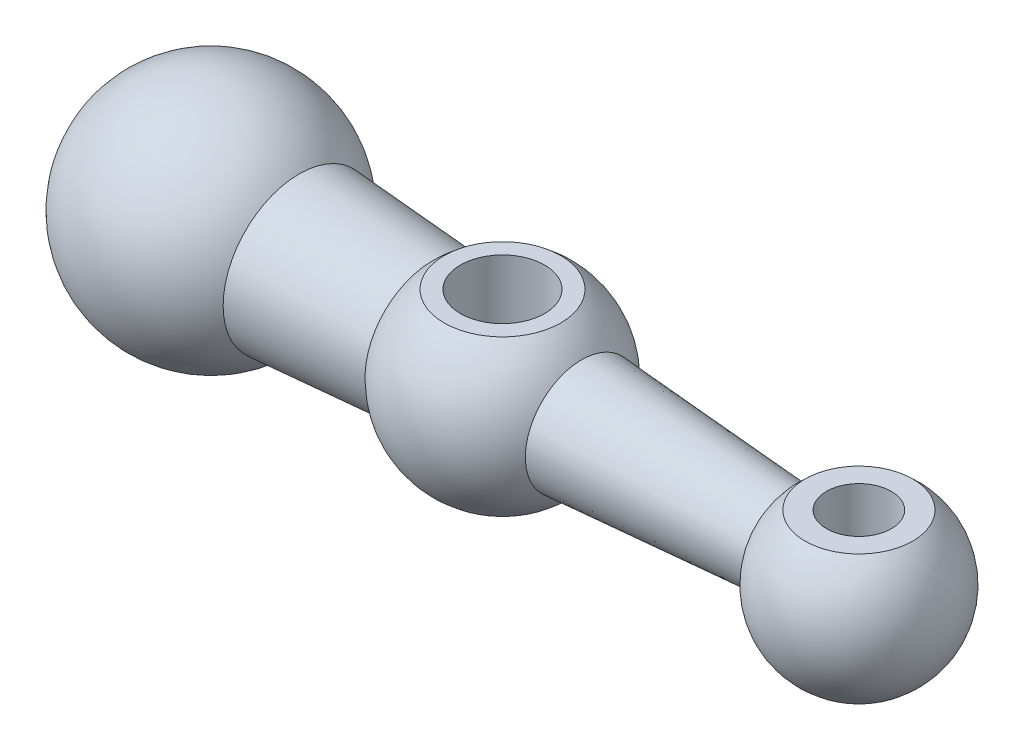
ISO-10303-21;
HEADER;
FILE_DESCRIPTION(('STEP AP214'),'2;1');
FILE_NAME('part.step','',(''),(''),'','','');
FILE_SCHEMA(('AUTOMOTIVE_DESIGN { 1 0 10303 214 1 1 1 1 }'));
ENDSEC;
DATA;
#1=APPLICATION_CONTEXT('core data for automotive mechanical design processes');
#2=APPLICATION_PROTOCOL_DEFINITION('international standard','automotive_design',2000,#1);
#3=PRODUCT_CONTEXT('',#1,'mechanical');
#4=PRODUCT('Part','Part','',(#3));
#5=PRODUCT_RELATED_PRODUCT_CATEGORY('part','',(#4));
#6=PRODUCT_DEFINITION_FORMATION('','',#4);
#7=PRODUCT_DEFINITION_CONTEXT('part definition',#1,'design');
#8=PRODUCT_DEFINITION('design','',#6,#7);
#9=PRODUCT_DEFINITION_SHAPE('','',#8);
#10=(LENGTH_UNIT() NAMED_UNIT(*) SI_UNIT(.MILLI.,.METRE.));
#11=(NAMED_UNIT(*) PLANE_ANGLE_UNIT() SI_UNIT($,.RADIAN.));
#12=(NAMED_UNIT(*) SI_UNIT($,.STERADIAN.) SOLID_ANGLE_UNIT());
#13=UNCERTAINTY_MEASURE_WITH_UNIT(LENGTH_MEASURE(1.E-05),#10,'distance_accuracy_value','');
#14=(GEOMETRIC_REPRESENTATION_CONTEXT(3) GLOBAL_UNCERTAINTY_ASSIGNED_CONTEXT((#13)) GLOBAL_UNIT_ASSIGNED_CONTEXT((#10,
#11,#12)) REPRESENTATION_CONTEXT('',''));
#15=CARTESIAN_POINT('',(0.,0.,0.));
#16=DIRECTION('',(0.,0.,1.));
#17=DIRECTION('',(1.,0.,0.));
#18=AXIS2_PLACEMENT_3D('',#15,#16,#17);
#19=CARTESIAN_POINT('',(10.,0.,0.));
#20=DIRECTION('',(-1.,0.,0.));
#21=DIRECTION('',(0.,0.,-1.));
#22=AXIS2_PLACEMENT_3D('',#19,#20,#21);
#23=CONICAL_SURFACE('',#22,12.,0.0698131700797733);
#24=CARTESIAN_POINT('',(88.7382566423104,0.,0.));
#25=DIRECTION('',(1.,0.,0.));
#26=DIRECTION('',(0.,0.,-1.));
#27=AXIS2_PLACEMENT_3D('',#24,#25,#26);
#28=CIRCLE('',#27,6.49408473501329);
#29=CARTESIAN_POINT('',(88.7382566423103,0.,-6.49408473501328));
#30=VERTEX_POINT('',#29);
#31=EDGE_CURVE('E59',#30,#30,#28,.T.);
#32=CARTESIAN_POINT('',(57.2206640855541,0.,0.));
#33=DIRECTION('',(-1.,0.,0.));
#34=DIRECTION('',(0.,0.,1.));
#35=AXIS2_PLACEMENT_3D('',#32,#33,#34);
#36=CIRCLE('',#35,8.69800950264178);
#37=CARTESIAN_POINT('',(57.2206640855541,0.,-8.69800950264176));
#38=VERTEX_POINT('',#37);
#39=EDGE_CURVE('E11',#38,#38,#36,.T.);
#40=CARTESIAN_POINT('',(88.7382566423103,0.,-6.49408473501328));
#41=CARTESIAN_POINT('',(88.4099483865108,0.,-6.51704228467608));
#42=CARTESIAN_POINT('',(88.0816401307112,0.,-6.53999983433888));
#43=CARTESIAN_POINT('',(87.4250236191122,0.,-6.58591493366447));
#44=CARTESIAN_POINT('',(87.0967153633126,0.,-6.60887248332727));
#45=CARTESIAN_POINT('',(86.4400988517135,0.,-6.65478758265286));
#46=CARTESIAN_POINT('',(86.111790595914,0.,-6.67774513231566));
#47=CARTESIAN_POINT('',(85.4551740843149,0.,-6.72366023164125));
#48=CARTESIAN_POINT('',(85.1268658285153,0.,-6.74661778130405));
#49=CARTESIAN_POINT('',(84.4702493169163,0.,-6.79253288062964));
#50=CARTESIAN_POINT('',(84.1419410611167,0.,-6.81549043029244));
#51=CARTESIAN_POINT('',(83.4853245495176,0.,-6.86140552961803));
#52=CARTESIAN_POINT('',(83.1570162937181,0.,-6.88436307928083));
#53=CARTESIAN_POINT('',(82.500399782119,0.,-6.93027817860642));
#54=CARTESIAN_POINT('',(82.1720915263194,0.,-6.95323572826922));
#55=CARTESIAN_POINT('',(81.5154750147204,0.,-6.99915082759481));
#56=CARTESIAN_POINT('',(81.1871667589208,0.,-7.02210837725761));
#57=CARTESIAN_POINT('',(80.5305502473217,0.,-7.0680234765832));
#58=CARTESIAN_POINT('',(80.2022419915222,0.,-7.090981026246));
#59=CARTESIAN_POINT('',(79.5456254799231,0.,-7.13689612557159));
#60=CARTESIAN_POINT('',(79.2173172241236,0.,-7.15985367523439));
#61=CARTESIAN_POINT('',(78.5607007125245,0.,-7.20576877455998));
#62=CARTESIAN_POINT('',(78.2323924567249,0.,-7.22872632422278));
#63=CARTESIAN_POINT('',(77.5757759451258,0.,-7.27464142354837));
#64=CARTESIAN_POINT('',(77.2474676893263,0.,-7.29759897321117));
#65=CARTESIAN_POINT('',(76.5908511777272,0.,-7.34351407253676));
#66=CARTESIAN_POINT('',(76.2625429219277,0.,-7.36647162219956));
#67=CARTESIAN_POINT('',(75.6059264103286,0.,-7.41238672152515));
#68=CARTESIAN_POINT('',(75.277618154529,0.,-7.43534427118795));
#69=CARTESIAN_POINT('',(74.6210016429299,0.,-7.48125937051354));
#70=CARTESIAN_POINT('',(74.2926933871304,0.,-7.50421692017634));
#71=CARTESIAN_POINT('',(73.6360768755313,0.,-7.55013201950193));
#72=CARTESIAN_POINT('',(73.3077686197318,0.,-7.57308956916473));
#73=CARTESIAN_POINT('',(72.6511521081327,0.,-7.61900466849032));
#74=CARTESIAN_POINT('',(72.3228438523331,0.,-7.64196221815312));
#75=CARTESIAN_POINT('',(71.6662273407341,0.,-7.68787731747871));
#76=CARTESIAN_POINT('',(71.3379190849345,0.,-7.71083486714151));
#77=CARTESIAN_POINT('',(70.6813025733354,0.,-7.7567499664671));
#78=CARTESIAN_POINT('',(70.3529943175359,0.,-7.7797075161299));
#79=CARTESIAN_POINT('',(69.6963778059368,0.,-7.82562261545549));
#80=CARTESIAN_POINT('',(69.3680695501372,0.,-7.84858016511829));
#81=CARTESIAN_POINT('',(68.7114530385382,0.,-7.89449526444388));
#82=CARTESIAN_POINT('',(68.3831447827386,0.,-7.91745281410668));
#83=CARTESIAN_POINT('',(67.7265282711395,0.,-7.96336791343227));
#84=CARTESIAN_POINT('',(67.39822001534,0.,-7.98632546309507));
#85=CARTESIAN_POINT('',(66.7416035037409,0.,-8.03224056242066));
#86=CARTESIAN_POINT('',(66.4132952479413,0.,-8.05519811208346));
#87=CARTESIAN_POINT('',(65.7566787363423,0.,-8.10111321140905));
#88=CARTESIAN_POINT('',(65.4283704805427,0.,-8.12407076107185));
#89=CARTESIAN_POINT('',(64.7717539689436,0.,-8.16998586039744));
#90=CARTESIAN_POINT('',(64.4434457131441,0.,-8.19294341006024));
#91=CARTESIAN_POINT('',(63.786829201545,0.,-8.23885850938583));
#92=CARTESIAN_POINT('',(63.4585209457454,0.,-8.26181605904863));
#93=CARTESIAN_POINT('',(62.8019044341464,0.,-8.30773115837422));
#94=CARTESIAN_POINT('',(62.4735961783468,0.,-8.33068870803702));
#95=CARTESIAN_POINT('',(61.8169796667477,0.,-8.37660380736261));
#96=CARTESIAN_POINT('',(61.4886714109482,0.,-8.39956135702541));
#97=CARTESIAN_POINT('',(60.8320548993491,0.,-8.445476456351));
#98=CARTESIAN_POINT('',(60.5037466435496,0.,-8.4684340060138));
#99=CARTESIAN_POINT('',(59.8471301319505,0.,-8.51434910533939));
#100=CARTESIAN_POINT('',(59.5188218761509,0.,-8.53730665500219));
#101=CARTESIAN_POINT('',(58.8622053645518,0.,-8.58322175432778));
#102=CARTESIAN_POINT('',(58.5338971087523,0.,-8.60617930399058));
#103=CARTESIAN_POINT('',(57.8772805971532,0.,-8.65209440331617));
#104=CARTESIAN_POINT('',(57.5489723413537,0.,-8.67505195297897));
#105=CARTESIAN_POINT('',(57.2206640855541,0.,-8.69800950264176));
#106=B_SPLINE_CURVE_WITH_KNOTS('',3,(#40,#41,#42,#43,#44,#45,#46,#47,#48,#49,#50,#51,#52,#53,
#54,#55,#56,#57,#58,#59,#60,#61,#62,#63,#64,#65,#66,#67,#68,#69,#70,#71,#72,#73,#74,#75,#76,#77,
#78,#79,#80,#81,#82,#83,#84,#85,#86,#87,#88,#89,#90,#91,#92,#93,#94,#95,#96,#97,#98,#99,#100,
#101,#102,#103,#104,#105),.UNSPECIFIED.,.F.,.F.,(4,2,2,2,2,2,2,2,2,2,2,2,2,2,2,2,2,2,2,2,2,2,2,
2,2,2,2,2,2,2,2,2,4),(0.,0.987329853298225,1.97465970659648,2.96198955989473,3.94931941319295,
4.93664926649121,5.92397911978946,6.91130897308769,7.89863882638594,8.88596867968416,
9.87329853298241,10.8606283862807,11.8479582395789,12.8352880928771,13.8226179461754,
14.8099477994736,15.7972776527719,16.7846075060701,17.7719373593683,18.7592672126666,
19.7465970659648,20.7339269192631,21.7212567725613,22.7085866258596,23.6959164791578,
24.683246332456,25.6705761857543,26.6579060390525,27.6452358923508,28.632565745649,
29.6198955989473,30.6072254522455,31.5945553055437),.UNSPECIFIED.);
#107=EDGE_CURVE('BSEAM30',#30,#38,#106,.T.);
#108=ORIENTED_EDGE('',*,*,#31,.F.);
#109=ORIENTED_EDGE('',*,*,#39,.F.);
#110=ORIENTED_EDGE('',*,*,#107,.T.);
#111=ORIENTED_EDGE('',*,*,#107,.F.);
#112=EDGE_LOOP('',(#108,#110,#109,#111));
#113=FACE_BOUND('',#112,.T.);
#114=ADVANCED_FACE('F30',(#113),#23,.T.);
#115=CARTESIAN_POINT('',(45.,0.,0.));
#116=DIRECTION('',(0.,1.,0.));
#117=DIRECTION('',(-1.,0.,0.));
#118=AXIS2_PLACEMENT_3D('',#115,#116,#117);
#119=SPHERICAL_SURFACE('',#118,15.);
#120=CARTESIAN_POINT('',(45.,-12.,0.));
#121=DIRECTION('',(0.,1.,0.));
#122=DIRECTION('',(0.,0.,1.));
#123=AXIS2_PLACEMENT_3D('',#120,#121,#122);
#124=CIRCLE('',#123,9.);
#125=CARTESIAN_POINT('',(45.,-12.,9.00000000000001));
#126=VERTEX_POINT('',#125);
#127=EDGE_CURVE('E70',#126,#126,#124,.T.);
#128=ORIENTED_EDGE('',*,*,#127,.T.);
#129=EDGE_LOOP('',(#128));
#130=FACE_BOUND('',#129,.T.);
#131=CARTESIAN_POINT('',(45.,12.,0.));
#132=DIRECTION('',(0.,-1.,0.));
#133=DIRECTION('',(0.,0.,-1.));
#134=AXIS2_PLACEMENT_3D('',#131,#132,#133);
#135=CIRCLE('',#134,9.);
#136=CARTESIAN_POINT('',(45.,12.,-8.99999999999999));
#137=VERTEX_POINT('',#136);
#138=EDGE_CURVE('E63',#137,#137,#135,.T.);
#139=ORIENTED_EDGE('',*,*,#138,.T.);
#140=EDGE_LOOP('',(#139));
#141=FACE_BOUND('',#140,.T.);
#142=CARTESIAN_POINT('',(34.1087955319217,0.,0.));
#143=DIRECTION('',(1.,0.,0.));
#144=DIRECTION('',(0.,0.,-1.));
#145=AXIS2_PLACEMENT_3D('',#142,#143,#144);
#146=CIRCLE('',#145,10.3141487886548);
#147=CARTESIAN_POINT('',(34.1087955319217,0.,-10.3141487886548));
#148=VERTEX_POINT('',#147);
#149=EDGE_CURVE('E38',#148,#148,#146,.T.);
#150=ORIENTED_EDGE('',*,*,#149,.T.);
#151=EDGE_LOOP('',(#150));
#152=FACE_BOUND('',#151,.T.);
#153=ORIENTED_EDGE('',*,*,#39,.T.);
#154=EDGE_LOOP('',(#153));
#155=FACE_BOUND('',#154,.T.);
#156=ADVANCED_FACE('F95',(#130,#141,#152,#155),#119,.T.);
#157=CARTESIAN_POINT('',(0.,0.,0.));
#158=DIRECTION('',(0.,1.,0.));
#159=DIRECTION('',(1.,0.,0.));
#160=AXIS2_PLACEMENT_3D('',#157,#158,#159);
#161=SPHERICAL_SURFACE('',#160,18.);
#162=CARTESIAN_POINT('',(0.,0.,0.));
#163=DIRECTION('',(-1.,0.,0.));
#164=DIRECTION('',(0.,0.,1.));
#165=AXIS2_PLACEMENT_3D('',#162,#163,#164);
#166=SPHERICAL_SURFACE('',#165,18.);
#167=CARTESIAN_POINT('',(13.639782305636,0.,0.));
#168=DIRECTION('',(-1.,0.,0.));
#169=DIRECTION('',(0.,0.,1.));
#170=AXIS2_PLACEMENT_3D('',#167,#168,#169);
#171=CIRCLE('',#170,11.7454816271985);
#172=CARTESIAN_POINT('',(13.639782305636,0.,-11.7454816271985));
#173=VERTEX_POINT('',#172);
#174=EDGE_CURVE('E62',#173,#173,#171,.F.);
#175=ORIENTED_EDGE('',*,*,#174,.F.);
#176=EDGE_LOOP('',(#175));
#177=FACE_BOUND('',#176,.T.);
#178=ADVANCED_FACE('F32',(#177),#166,.T.);
#179=CARTESIAN_POINT('',(13.639782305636,0.,-11.7454816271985));
#180=CARTESIAN_POINT('',(13.8530011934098,0.,-11.7305719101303));
#181=CARTESIAN_POINT('',(14.0662200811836,0.,-11.7156621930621));
#182=CARTESIAN_POINT('',(14.4926578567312,0.,-11.6858427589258));
#183=CARTESIAN_POINT('',(14.7058767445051,0.,-11.6709330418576));
#184=CARTESIAN_POINT('',(15.1323145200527,0.,-11.6411136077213));
#185=CARTESIAN_POINT('',(15.3455334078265,0.,-11.6262038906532));
#186=CARTESIAN_POINT('',(15.7719711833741,0.,-11.5963844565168));
#187=CARTESIAN_POINT('',(15.9851900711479,0.,-11.5814747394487));
#188=CARTESIAN_POINT('',(16.4116278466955,0.,-11.5516553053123));
#189=CARTESIAN_POINT('',(16.6248467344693,0.,-11.5367455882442));
#190=CARTESIAN_POINT('',(17.051284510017,0.,-11.5069261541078));
#191=CARTESIAN_POINT('',(17.2645033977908,0.,-11.4920164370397));
#192=CARTESIAN_POINT('',(17.6909411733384,0.,-11.4621970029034));
#193=CARTESIAN_POINT('',(17.9041600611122,0.,-11.4472872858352));
#194=CARTESIAN_POINT('',(18.3305978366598,0.,-11.4174678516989));
#195=CARTESIAN_POINT('',(18.5438167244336,0.,-11.4025581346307));
#196=CARTESIAN_POINT('',(18.9702544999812,0.,-11.3727387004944));
#197=CARTESIAN_POINT('',(19.183473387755,0.,-11.3578289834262));
#198=CARTESIAN_POINT('',(19.6099111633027,0.,-11.3280095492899));
#199=CARTESIAN_POINT('',(19.8231300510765,0.,-11.3130998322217));
#200=CARTESIAN_POINT('',(20.2495678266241,0.,-11.2832803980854));
#201=CARTESIAN_POINT('',(20.4627867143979,0.,-11.2683706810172));
#202=CARTESIAN_POINT('',(20.8892244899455,0.,-11.2385512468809));
#203=CARTESIAN_POINT('',(21.1024433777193,0.,-11.2236415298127));
#204=CARTESIAN_POINT('',(21.5288811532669,0.,-11.1938220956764));
#205=CARTESIAN_POINT('',(21.7421000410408,0.,-11.1789123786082));
#206=CARTESIAN_POINT('',(22.1685378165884,0.,-11.1490929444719));
#207=CARTESIAN_POINT('',(22.3817567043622,0.,-11.1341832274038));
#208=CARTESIAN_POINT('',(22.8081944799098,0.,-11.1043637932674));
#209=CARTESIAN_POINT('',(23.0214133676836,0.,-11.0894540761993));
#210=CARTESIAN_POINT('',(23.4478511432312,0.,-11.0596346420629));
#211=CARTESIAN_POINT('',(23.661070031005,0.,-11.0447249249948));
#212=CARTESIAN_POINT('',(24.0875078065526,0.,-11.0149054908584));
#213=CARTESIAN_POINT('',(24.3007266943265,0.,-10.9999957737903));
#214=CARTESIAN_POINT('',(24.7271644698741,0.,-10.970176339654));
#215=CARTESIAN_POINT('',(24.9403833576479,0.,-10.9552666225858));
#216=CARTESIAN_POINT('',(25.3668211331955,0.,-10.9254471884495));
#217=CARTESIAN_POINT('',(25.5800400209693,0.,-10.9105374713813));
#218=CARTESIAN_POINT('',(26.0064777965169,0.,-10.880718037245));
#219=CARTESIAN_POINT('',(26.2196966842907,0.,-10.8658083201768));
#220=CARTESIAN_POINT('',(26.6461344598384,0.,-10.8359888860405));
#221=CARTESIAN_POINT('',(26.8593533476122,0.,-10.8210791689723));
#222=CARTESIAN_POINT('',(27.2857911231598,0.,-10.791259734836));
#223=CARTESIAN_POINT('',(27.4990100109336,0.,-10.7763500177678));
#224=CARTESIAN_POINT('',(27.9254477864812,0.,-10.7465305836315));
#225=CARTESIAN_POINT('',(28.138666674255,0.,-10.7316208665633));
#226=CARTESIAN_POINT('',(28.5651044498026,0.,-10.701801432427));
#227=CARTESIAN_POINT('',(28.7783233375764,0.,-10.6868917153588));
#228=CARTESIAN_POINT('',(29.2047611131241,0.,-10.6570722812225));
#229=CARTESIAN_POINT('',(29.4179800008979,0.,-10.6421625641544));
#230=CARTESIAN_POINT('',(29.8444177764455,0.,-10.612343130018));
#231=CARTESIAN_POINT('',(30.0576366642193,0.,-10.5974334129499));
#232=CARTESIAN_POINT('',(30.4840744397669,0.,-10.5676139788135));
#233=CARTESIAN_POINT('',(30.6972933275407,0.,-10.5527042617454));
#234=CARTESIAN_POINT('',(31.1237311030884,0.,-10.522884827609));
#235=CARTESIAN_POINT('',(31.3369499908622,0.,-10.5079751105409));
#236=CARTESIAN_POINT('',(31.7633877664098,0.,-10.4781556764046));
#237=CARTESIAN_POINT('',(31.9766066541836,0.,-10.4632459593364));
#238=CARTESIAN_POINT('',(32.4030444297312,0.,-10.4334265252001));
#239=CARTESIAN_POINT('',(32.616263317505,0.,-10.4185168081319));
#240=CARTESIAN_POINT('',(33.0427010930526,0.,-10.3886973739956));
#241=CARTESIAN_POINT('',(33.2559199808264,0.,-10.3737876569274));
#242=CARTESIAN_POINT('',(33.6823577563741,0.,-10.3439682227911));
#243=CARTESIAN_POINT('',(33.8955766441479,0.,-10.3290585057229));
#244=CARTESIAN_POINT('',(34.1087955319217,0.,-10.3141487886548));
#245=B_SPLINE_CURVE_WITH_KNOTS('',3,(#179,#180,#181,#182,#183,#184,#185,#186,#187,#188,#189,
#190,#191,#192,#193,#194,#195,#196,#197,#198,#199,#200,#201,#202,#203,#204,#205,#206,#207,#208,
#209,#210,#211,#212,#213,#214,#215,#216,#217,#218,#219,#220,#221,#222,#223,#224,#225,#226,#227,
#228,#229,#230,#231,#232,#233,#234,#235,#236,#237,#238,#239,#240,#241,#242,#243,#244),
.UNSPECIFIED.,.F.,.F.,(4,2,2,2,2,2,2,2,2,2,2,2,2,2,2,2,2,2,2,2,2,2,2,2,2,2,2,2,2,2,2,2,4),(0.,
0.6412186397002,1.2824372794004,1.9236559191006,2.5648745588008,3.206093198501,3.8473118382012,
4.4885304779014,5.1297491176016,5.7709677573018,6.41218639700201,7.05340503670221,
7.69462367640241,8.33584231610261,8.97706095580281,9.618279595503,10.2594982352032,
10.9007168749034,11.5419355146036,12.1831541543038,12.824372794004,13.4655914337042,
14.1068100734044,14.7480287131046,15.3892473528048,16.030465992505,16.6716846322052,
17.3129032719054,17.9541219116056,18.5953405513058,19.236559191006,19.8777778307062,
20.5189964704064),.UNSPECIFIED.);
#246=EDGE_CURVE('BSEAM97',#173,#148,#245,.T.);
#247=ORIENTED_EDGE('',*,*,#174,.T.);
#248=ORIENTED_EDGE('',*,*,#149,.F.);
#249=ORIENTED_EDGE('',*,*,#246,.T.);
#250=ORIENTED_EDGE('',*,*,#246,.F.);
#251=EDGE_LOOP('',(#247,#249,#248,#250));
#252=FACE_BOUND('',#251,.T.);
#253=ADVANCED_FACE('F97',(#252),#23,.T.);
#254=CARTESIAN_POINT('',(100.,0.,0.));
#255=DIRECTION('',(0.,1.,0.));
#256=DIRECTION('',(1.,0.,0.));
#257=AXIS2_PLACEMENT_3D('',#254,#255,#256);
#258=SPHERICAL_SURFACE('',#257,13.);
#259=CARTESIAN_POINT('',(100.,10.,0.));
#260=DIRECTION('',(0.,-1.,0.));
#261=DIRECTION('',(0.,0.,-1.));
#262=AXIS2_PLACEMENT_3D('',#259,#260,#261);
#263=CIRCLE('',#262,8.30662386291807);
#264=CARTESIAN_POINT('',(100.,10.,-8.30662386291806));
#265=VERTEX_POINT('',#264);
#266=EDGE_CURVE('E72',#265,#265,#263,.T.);
#267=ORIENTED_EDGE('',*,*,#266,.T.);
#268=EDGE_LOOP('',(#267));
#269=FACE_BOUND('',#268,.T.);
#270=ORIENTED_EDGE('',*,*,#31,.T.);
#271=EDGE_LOOP('',(#270));
#272=FACE_BOUND('',#271,.T.);
#273=ADVANCED_FACE('F106',(#269,#272),#258,.T.);
#274=CARTESIAN_POINT('',(30.8738757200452,12.,-18.));
#275=DIRECTION('',(0.,-1.,0.));
#276=DIRECTION('',(0.,0.,-1.));
#277=AXIS2_PLACEMENT_3D('',#274,#275,#276);
#278=PLANE('',#277);
#279=CARTESIAN_POINT('',(45.,12.,0.));
#280=DIRECTION('',(0.,1.,0.));
#281=DIRECTION('',(0.,0.,1.));
#282=AXIS2_PLACEMENT_3D('',#279,#280,#281);
#283=CIRCLE('',#282,6.49999999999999);
#284=CARTESIAN_POINT('',(45.,12.,6.5));
#285=VERTEX_POINT('',#284);
#286=EDGE_CURVE('E54',#285,#285,#283,.T.);
#287=ORIENTED_EDGE('',*,*,#286,.F.);
#288=EDGE_LOOP('',(#287));
#289=FACE_BOUND('',#288,.T.);
#290=ORIENTED_EDGE('',*,*,#138,.F.);
#291=EDGE_LOOP('',(#290));
#292=FACE_BOUND('',#291,.T.);
#293=ADVANCED_FACE('F112',(#289,#292),#278,.F.);
#294=CARTESIAN_POINT('',(30.8738757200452,-12.,-18.));
#295=DIRECTION('',(0.,1.,0.));
#296=DIRECTION('',(0.,0.,1.));
#297=AXIS2_PLACEMENT_3D('',#294,#295,#296);
#298=PLANE('',#297);
#299=CARTESIAN_POINT('',(45.,-12.,0.));
#300=DIRECTION('',(0.,1.,0.));
#301=DIRECTION('',(0.,0.,1.));
#302=AXIS2_PLACEMENT_3D('',#299,#300,#301);
#303=CIRCLE('',#302,6.49999999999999);
#304=CARTESIAN_POINT('',(45.,-12.,6.5));
#305=VERTEX_POINT('',#304);
#306=EDGE_CURVE('E34',#305,#305,#303,.T.);
#307=ORIENTED_EDGE('',*,*,#306,.T.);
#308=EDGE_LOOP('',(#307));
#309=FACE_BOUND('',#308,.T.);
#310=ORIENTED_EDGE('',*,*,#127,.F.);
#311=EDGE_LOOP('',(#310));
#312=FACE_BOUND('',#311,.T.);
#313=ADVANCED_FACE('F79',(#309,#312),#298,.F.);
#314=CARTESIAN_POINT('',(87.8737418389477,10.,-18.));
#315=DIRECTION('',(0.,-1.,0.));
#316=DIRECTION('',(0.,0.,-1.));
#317=AXIS2_PLACEMENT_3D('',#314,#315,#316);
#318=PLANE('',#317);
#319=CARTESIAN_POINT('',(100.,10.,0.));
#320=DIRECTION('',(0.,1.,0.));
#321=DIRECTION('',(0.,0.,1.));
#322=AXIS2_PLACEMENT_3D('',#319,#320,#321);
#323=CIRCLE('',#322,4.99999999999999);
#324=CARTESIAN_POINT('',(100.,10.,5.));
#325=VERTEX_POINT('',#324);
#326=EDGE_CURVE('E51',#325,#325,#323,.T.);
#327=ORIENTED_EDGE('',*,*,#326,.F.);
#328=EDGE_LOOP('',(#327));
#329=FACE_BOUND('',#328,.T.);
#330=ORIENTED_EDGE('',*,*,#266,.F.);
#331=EDGE_LOOP('',(#330));
#332=FACE_BOUND('',#331,.T.);
#333=ADVANCED_FACE('F84',(#329,#332),#318,.F.);
#334=CARTESIAN_POINT('',(45.,12.,0.));
#335=DIRECTION('',(0.,1.,0.));
#336=DIRECTION('',(0.,0.,1.));
#337=AXIS2_PLACEMENT_3D('',#334,#335,#336);
#338=CYLINDRICAL_SURFACE('',#337,6.49999999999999);
#339=ORIENTED_EDGE('',*,*,#286,.T.);
#340=EDGE_LOOP('',(#339));
#341=FACE_BOUND('',#340,.T.);
#342=ORIENTED_EDGE('',*,*,#306,.F.);
#343=EDGE_LOOP('',(#342));
#344=FACE_BOUND('',#343,.T.);
#345=ADVANCED_FACE('F82',(#341,#344),#338,.F.);
#346=CARTESIAN_POINT('',(100.,10.,0.));
#347=DIRECTION('',(0.,1.,0.));
#348=DIRECTION('',(0.,0.,1.));
#349=AXIS2_PLACEMENT_3D('',#346,#347,#348);
#350=CYLINDRICAL_SURFACE('',#349,4.99999999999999);
#351=CARTESIAN_POINT('',(100.,0.,0.));
#352=DIRECTION('',(0.,1.,0.));
#353=DIRECTION('',(0.,0.,1.));
#354=AXIS2_PLACEMENT_3D('',#351,#352,#353);
#355=CIRCLE('',#354,4.99999999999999);
#356=CARTESIAN_POINT('',(100.,0.,5.));
#357=VERTEX_POINT('',#356);
#358=EDGE_CURVE('E49',#357,#357,#355,.T.);
#359=ORIENTED_EDGE('',*,*,#358,.F.);
#360=EDGE_LOOP('',(#359));
#361=FACE_BOUND('',#360,.T.);
#362=ORIENTED_EDGE('',*,*,#326,.T.);
#363=EDGE_LOOP('',(#362));
#364=FACE_BOUND('',#363,.T.);
#365=ADVANCED_FACE('F45',(#361,#364),#350,.F.);
#366=CARTESIAN_POINT('',(100.,0.,0.));
#367=DIRECTION('',(0.,1.,0.));
#368=DIRECTION('',(0.,0.,1.));
#369=AXIS2_PLACEMENT_3D('',#366,#367,#368);
#370=CONICAL_SURFACE('',#369,4.99999999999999,1.02974425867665);
#371=CARTESIAN_POINT('',(100.,-3.00430309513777,0.));
#372=VERTEX_POINT('',#371);
#373=VERTEX_LOOP('',#372);
#374=FACE_BOUND('',#373,.T.);
#375=ORIENTED_EDGE('',*,*,#358,.T.);
#376=EDGE_LOOP('',(#375));
#377=FACE_BOUND('',#376,.T.);
#378=ADVANCED_FACE('F42',(#374,#377),#370,.F.);
#379=CLOSED_SHELL('',(#114,#156,#178,#253,#273,#293,#313,#333,#345,#365,#378));
#380=MANIFOLD_SOLID_BREP('B2',#379);
#381=ADVANCED_BREP_SHAPE_REPRESENTATION('',(#18,#380),#14);
#382=SHAPE_DEFINITION_REPRESENTATION(#9,#381);
ENDSEC;
END-ISO-10303-21;
